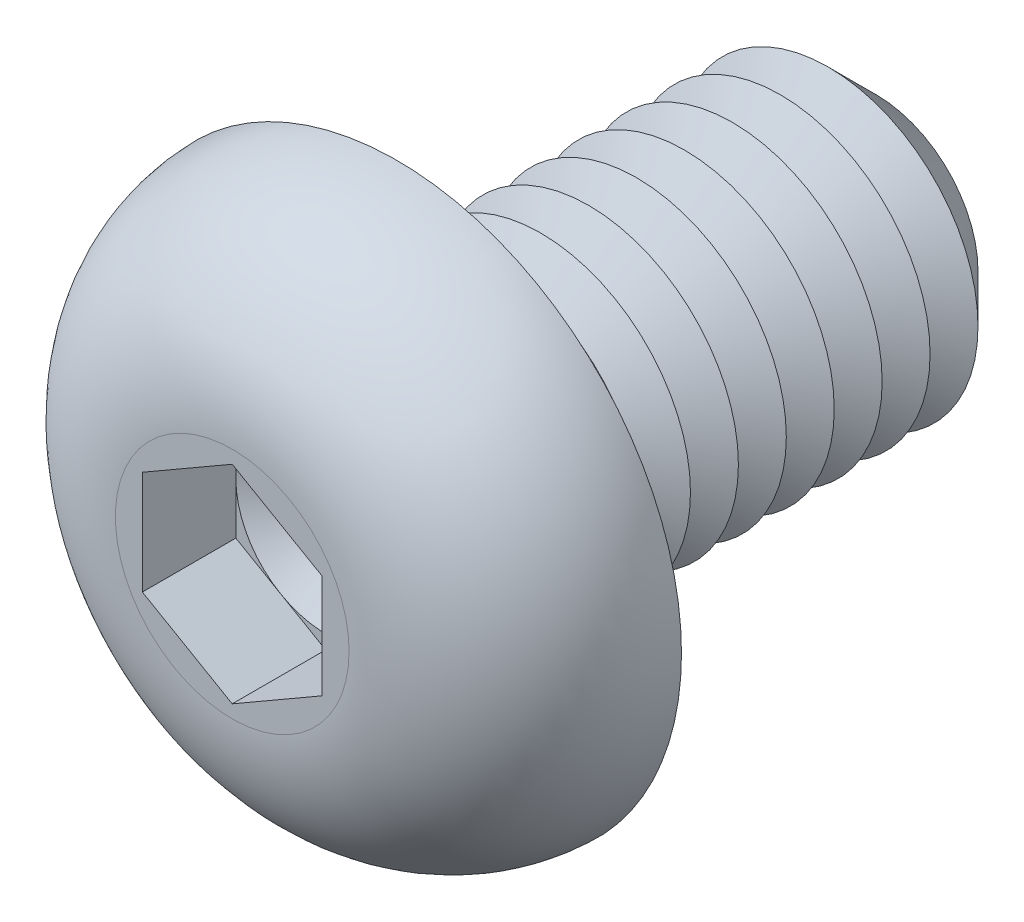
from build123d import *

# Parameters (mm, degrees)
CUT_EXTRUDE1_DEPTH  = 1.56
SKETCH4_R           = 2.5
BOSS_EXTRUDE1_DEPTH = 8
CHAMFER1_SIZE       = 0.8
LPATTERN1_COUNT     = 8
LPATTERN1_PITCH     = 0.8
FILLET2_R           = 0.4


with BuildPart() as part:
    # Sketch2 → Revolve1 (revolve)
    with BuildSketch(Plane(origin=(0, 0, 0), x_dir=(0, 0, -1), z_dir=(1, 0, 0)), mode=Mode.PRIVATE) as revolve1_sk:
        with BuildLine():
            Line((0, 0), (-2.75, 0))
            Line((-2.75, 0), (-2.75, 1.950446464))
            ThreePointArc((-2.75, 1.950446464), (-1.947498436, 3.912588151), (0, 4.75))
            Line((0, 4.75), (0, 0))
        make_face()
    revolve(revolve1_sk.sketch.rotate(Axis((0, 0, 47.934239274), (0, 0, -1)), 90), axis=Axis((0, 0, 47.934239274), (0, 0, -1)))

    # Sketch3 → Cut-Extrude1 (cut)
    with BuildSketch(Plane.XY.offset(2.75)):
        Polygon((0, 1.732050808), (-1.5, 0.866025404), (-1.5, -0.866025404), (0, -1.732050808), (1.5, -0.866025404), (1.5, 0.866025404), align=None)
    extrude(amount=-CUT_EXTRUDE1_DEPTH, mode=Mode.SUBTRACT)

    # Sketch4 → Boss-Extrude1 (add)
    with BuildSketch(Plane(origin=(0, 0, 0), x_dir=(-1, 0, 0), z_dir=(0, 0, -1))):
        with Locations(Location((0, 0, 0), (0, 0, 180))):
            Circle(SKETCH4_R)
    extrude(amount=BOSS_EXTRUDE1_DEPTH)

    # Chamfer1
    chamfer1_edges = [part.edges().sort_by_distance(p)[0] for p in [
        (-2.5, 0, -8),
    ]]
    chamfer(chamfer1_edges, length=CHAMFER1_SIZE)

    # Sketch5 → Cut-Revolve1 (revolve, cut)
    with BuildSketch(Plane(origin=(0, 0, 0), x_dir=(0, 0, -1), z_dir=(1, 0, 0)), mode=Mode.PRIVATE) as cut_revolve1_sk:
        Polygon((0.8, 2.5), (1.6, 2.5), (1.2, 1.807179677), align=None)
    cut_revolve1 = revolve(cut_revolve1_sk.sketch.rotate(Axis((0, 0, 47.934239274), (0, 0, -1)), 90), axis=Axis((0, 0, 47.934239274), (0, 0, -1)), mode=Mode.SUBTRACT)

    # LPattern1: Cut-Revolve1 ×8
    with Locations(*[(0, 0, -i * LPATTERN1_PITCH) for i in range(1, LPATTERN1_COUNT)]):
        add(cut_revolve1, mode=Mode.SUBTRACT)

    # Fillet2
    fillet2_edges = [part.edges().sort_by_distance(p)[0] for p in [
        (-2.5, 0, 0),
    ]]
    fillet(fillet2_edges, radius=FILLET2_R)

    # Cut-Extrude2 cone 1 section (on through the dimple's axis) → Cut-Extrude2 (revolve, cut)
    with BuildSketch(Plane(origin=(0, 0, 1.19), x_dir=(0, -1, 0), z_dir=(1, 0, 0))):
        Polygon((0, 0), (1.5, 0), (0, 0.866025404), align=None)
    revolve(axis=Axis((0, 0, 1.19), (0, 0, -1)), mode=Mode.SUBTRACT)


solid = part.part
